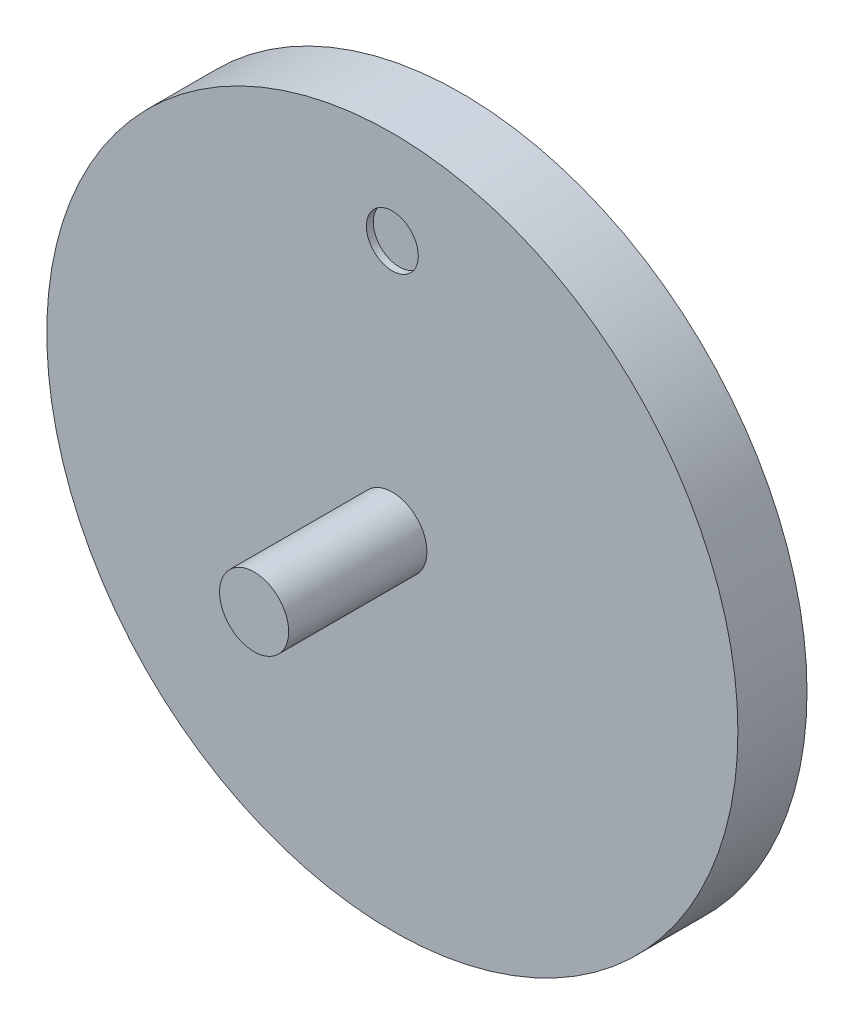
ISO-10303-21;
HEADER;
FILE_DESCRIPTION(('STEP AP214'),'2;1');
FILE_NAME('part.step','',(''),(''),'','','');
FILE_SCHEMA(('AUTOMOTIVE_DESIGN { 1 0 10303 214 1 1 1 1 }'));
ENDSEC;
DATA;
#1=APPLICATION_CONTEXT('core data for automotive mechanical design processes');
#2=APPLICATION_PROTOCOL_DEFINITION('international standard','automotive_design',2000,#1);
#3=PRODUCT_CONTEXT('',#1,'mechanical');
#4=PRODUCT('Part','Part','',(#3));
#5=PRODUCT_RELATED_PRODUCT_CATEGORY('part','',(#4));
#6=PRODUCT_DEFINITION_FORMATION('','',#4);
#7=PRODUCT_DEFINITION_CONTEXT('part definition',#1,'design');
#8=PRODUCT_DEFINITION('design','',#6,#7);
#9=PRODUCT_DEFINITION_SHAPE('','',#8);
#10=(LENGTH_UNIT() NAMED_UNIT(*) SI_UNIT(.MILLI.,.METRE.));
#11=(NAMED_UNIT(*) PLANE_ANGLE_UNIT() SI_UNIT($,.RADIAN.));
#12=(NAMED_UNIT(*) SI_UNIT($,.STERADIAN.) SOLID_ANGLE_UNIT());
#13=UNCERTAINTY_MEASURE_WITH_UNIT(LENGTH_MEASURE(1.E-05),#10,'distance_accuracy_value','');
#14=(GEOMETRIC_REPRESENTATION_CONTEXT(3) GLOBAL_UNCERTAINTY_ASSIGNED_CONTEXT((#13)) GLOBAL_UNIT_ASSIGNED_CONTEXT((#10,
#11,#12)) REPRESENTATION_CONTEXT('',''));
#15=CARTESIAN_POINT('',(0.,0.,0.));
#16=DIRECTION('',(0.,0.,1.));
#17=DIRECTION('',(1.,0.,0.));
#18=AXIS2_PLACEMENT_3D('',#15,#16,#17);
#19=CARTESIAN_POINT('',(0.,0.,100.));
#20=DIRECTION('',(0.,0.,1.));
#21=DIRECTION('',(1.,0.,0.));
#22=AXIS2_PLACEMENT_3D('',#19,#20,#21);
#23=PLANE('',#22);
#24=CARTESIAN_POINT('',(0.,364.679377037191,100.));
#25=DIRECTION('',(0.,0.,1.));
#26=DIRECTION('',(1.,0.,0.));
#27=AXIS2_PLACEMENT_3D('',#24,#25,#26);
#28=CIRCLE('',#27,37.5589742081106);
#29=CARTESIAN_POINT('',(37.5589742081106,364.679377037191,100.));
#30=VERTEX_POINT('',#29);
#31=EDGE_CURVE('E50',#30,#30,#28,.T.);
#32=ORIENTED_EDGE('',*,*,#31,.F.);
#33=EDGE_LOOP('',(#32));
#34=FACE_BOUND('',#33,.T.);
#35=CARTESIAN_POINT('',(0.,0.,100.));
#36=DIRECTION('',(0.,0.,1.));
#37=DIRECTION('',(1.,0.,0.));
#38=AXIS2_PLACEMENT_3D('',#35,#36,#37);
#39=CIRCLE('',#38,500.);
#40=CARTESIAN_POINT('',(500.,0.,100.));
#41=VERTEX_POINT('',#40);
#42=EDGE_CURVE('E10',#41,#41,#39,.T.);
#43=ORIENTED_EDGE('',*,*,#42,.T.);
#44=EDGE_LOOP('',(#43));
#45=FACE_BOUND('',#44,.T.);
#46=CARTESIAN_POINT('',(0.,0.,100.));
#47=DIRECTION('',(0.,0.,1.));
#48=DIRECTION('',(1.,0.,0.));
#49=AXIS2_PLACEMENT_3D('',#46,#47,#48);
#50=CIRCLE('',#49,50.);
#51=CARTESIAN_POINT('',(50.,0.,100.));
#52=VERTEX_POINT('',#51);
#53=EDGE_CURVE('E44',#52,#52,#50,.T.);
#54=ORIENTED_EDGE('',*,*,#53,.F.);
#55=EDGE_LOOP('',(#54));
#56=FACE_BOUND('',#55,.T.);
#57=ADVANCED_FACE('F31',(#34,#45,#56),#23,.T.);
#58=CARTESIAN_POINT('',(0.,0.,100.));
#59=DIRECTION('',(0.,0.,-1.));
#60=DIRECTION('',(-1.,0.,0.));
#61=AXIS2_PLACEMENT_3D('',#58,#59,#60);
#62=CYLINDRICAL_SURFACE('',#61,500.);
#63=ORIENTED_EDGE('',*,*,#42,.F.);
#64=EDGE_LOOP('',(#63));
#65=FACE_BOUND('',#64,.T.);
#66=CARTESIAN_POINT('',(0.,0.,0.));
#67=DIRECTION('',(0.,0.,1.));
#68=DIRECTION('',(1.,0.,0.));
#69=AXIS2_PLACEMENT_3D('',#66,#67,#68);
#70=CIRCLE('',#69,500.);
#71=CARTESIAN_POINT('',(500.,0.,0.));
#72=VERTEX_POINT('',#71);
#73=EDGE_CURVE('E35',#72,#72,#70,.T.);
#74=ORIENTED_EDGE('',*,*,#73,.T.);
#75=EDGE_LOOP('',(#74));
#76=FACE_BOUND('',#75,.T.);
#77=ADVANCED_FACE('F33',(#65,#76),#62,.T.);
#78=CARTESIAN_POINT('',(0.,0.,0.));
#79=DIRECTION('',(0.,0.,1.));
#80=DIRECTION('',(1.,0.,0.));
#81=AXIS2_PLACEMENT_3D('',#78,#79,#80);
#82=PLANE('',#81);
#83=ORIENTED_EDGE('',*,*,#73,.F.);
#84=EDGE_LOOP('',(#83));
#85=FACE_BOUND('',#84,.T.);
#86=ADVANCED_FACE('F72',(#85),#82,.F.);
#87=CARTESIAN_POINT('',(0.,0.,300.));
#88=DIRECTION('',(0.,0.,-1.));
#89=DIRECTION('',(-1.,0.,0.));
#90=AXIS2_PLACEMENT_3D('',#87,#88,#89);
#91=CYLINDRICAL_SURFACE('',#90,50.);
#92=CARTESIAN_POINT('',(0.,0.,300.));
#93=DIRECTION('',(0.,0.,1.));
#94=DIRECTION('',(1.,0.,0.));
#95=AXIS2_PLACEMENT_3D('',#92,#93,#94);
#96=CIRCLE('',#95,50.);
#97=CARTESIAN_POINT('',(50.,0.,300.));
#98=VERTEX_POINT('',#97);
#99=EDGE_CURVE('E42',#98,#98,#96,.T.);
#100=ORIENTED_EDGE('',*,*,#99,.F.);
#101=EDGE_LOOP('',(#100));
#102=FACE_BOUND('',#101,.T.);
#103=ORIENTED_EDGE('',*,*,#53,.T.);
#104=EDGE_LOOP('',(#103));
#105=FACE_BOUND('',#104,.T.);
#106=ADVANCED_FACE('F70',(#102,#105),#91,.T.);
#107=CARTESIAN_POINT('',(0.,0.,300.));
#108=DIRECTION('',(0.,0.,1.));
#109=DIRECTION('',(1.,0.,0.));
#110=AXIS2_PLACEMENT_3D('',#107,#108,#109);
#111=PLANE('',#110);
#112=ORIENTED_EDGE('',*,*,#99,.T.);
#113=EDGE_LOOP('',(#112));
#114=FACE_BOUND('',#113,.T.);
#115=ADVANCED_FACE('F61',(#114),#111,.T.);
#116=CARTESIAN_POINT('',(0.,364.679377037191,90.));
#117=DIRECTION('',(0.,0.,1.));
#118=DIRECTION('',(1.,0.,0.));
#119=AXIS2_PLACEMENT_3D('',#116,#117,#118);
#120=CYLINDRICAL_SURFACE('',#119,37.5589742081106);
#121=CARTESIAN_POINT('',(0.,364.679377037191,90.));
#122=DIRECTION('',(0.,0.,1.));
#123=DIRECTION('',(1.,0.,0.));
#124=AXIS2_PLACEMENT_3D('',#121,#122,#123);
#125=CIRCLE('',#124,37.5589742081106);
#126=CARTESIAN_POINT('',(37.5589742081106,364.679377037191,90.));
#127=VERTEX_POINT('',#126);
#128=EDGE_CURVE('E47',#127,#127,#125,.T.);
#129=ORIENTED_EDGE('',*,*,#128,.F.);
#130=EDGE_LOOP('',(#129));
#131=FACE_BOUND('',#130,.T.);
#132=ORIENTED_EDGE('',*,*,#31,.T.);
#133=EDGE_LOOP('',(#132));
#134=FACE_BOUND('',#133,.T.);
#135=ADVANCED_FACE('F58',(#131,#134),#120,.F.);
#136=CARTESIAN_POINT('',(0.,364.679377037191,90.));
#137=DIRECTION('',(0.,0.,1.));
#138=DIRECTION('',(1.,0.,0.));
#139=AXIS2_PLACEMENT_3D('',#136,#137,#138);
#140=PLANE('',#139);
#141=ORIENTED_EDGE('',*,*,#128,.T.);
#142=EDGE_LOOP('',(#141));
#143=FACE_BOUND('',#142,.T.);
#144=ADVANCED_FACE('F56',(#143),#140,.T.);
#145=CLOSED_SHELL('',(#57,#77,#86,#106,#115,#135,#144));
#146=MANIFOLD_SOLID_BREP('B2',#145);
#147=ADVANCED_BREP_SHAPE_REPRESENTATION('',(#18,#146),#14);
#148=SHAPE_DEFINITION_REPRESENTATION(#9,#147);
ENDSEC;
END-ISO-10303-21;
